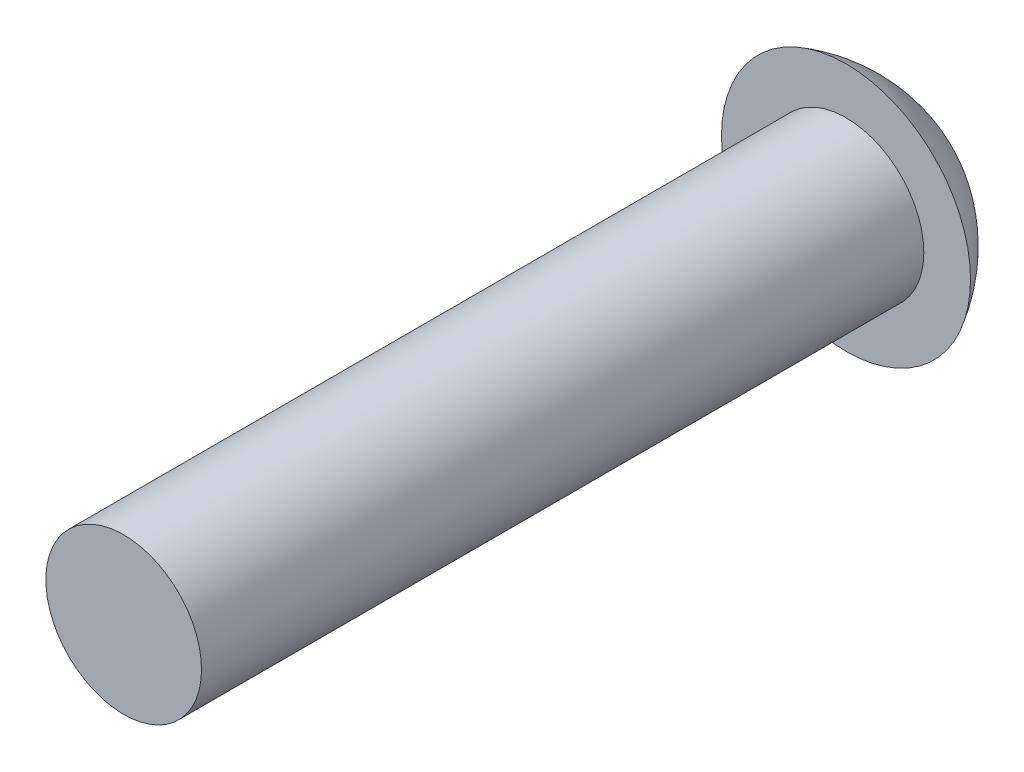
from build123d import *

# Parameters (mm, degrees)
SKETCH_1_R          = 2.5
EXTRUDE_1_DEPTH     = 11.6
CUT_EXTRUDE_START   = -1.5
CUT_EXTRUDE_1_DEPTH = 22


with BuildPart() as part:
    # Sketch 1 → Extrude 1 (new, symmetric)
    with BuildSketch(Plane.XY):
        Circle(SKETCH_1_R)
    extrude(amount=EXTRUDE_1_DEPTH, both=True)

    # Sketch 3 → Revolve 1 (revolve)
    with BuildSketch(Plane(origin=(0, 0, 0), x_dir=(1, 0, 0), z_dir=(0, 1, 0))):
        with BuildLine():
            Line((0, 11.6), (0, 14.1))
            ThreePointArc((0, 14.1), (-2.313336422, 13.351338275), (-4, 11.6))
            Line((-4, 11.6), (0, 11.6))
        make_face()
    revolve(axis=Axis((0, 0, -11.6), (0, 0, -1)))

    # Sketch 4 → Cut-Extrude 1 (cut)
    with BuildSketch(Plane(origin=(0, 0, 0), x_dir=(0, 0, -1), z_dir=(1, 0, 0)).offset(CUT_EXTRUDE_START)):
        with BuildLine():
            Line((-5, 1), (5, 1))
            ThreePointArc((5, 1), (6, 0), (5, -1))
            Line((5, -1), (-5, -1))
            ThreePointArc((-5, -1), (-6, 0), (-5, 1))
        make_face()
    extrude(amount=-CUT_EXTRUDE_1_DEPTH, mode=Mode.SUBTRACT)


solid = part.part
